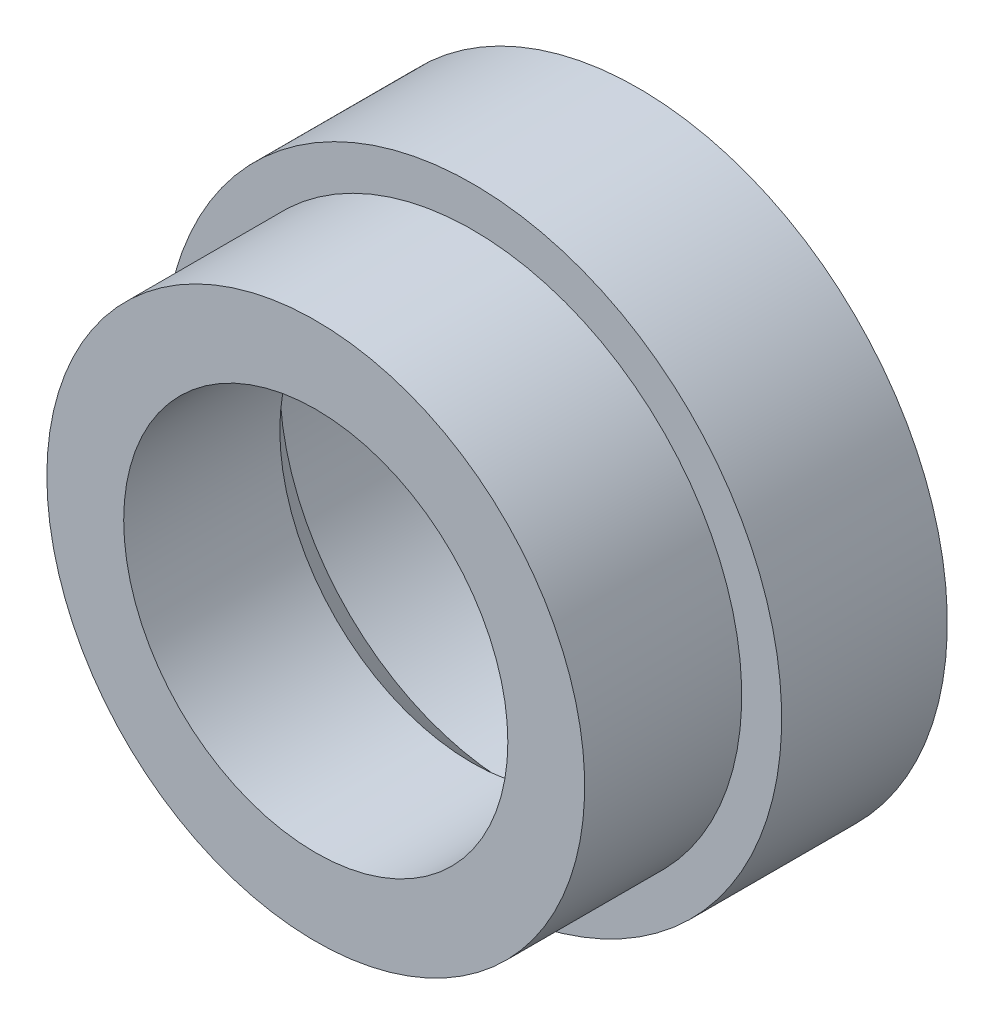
ISO-10303-21;
HEADER;
FILE_DESCRIPTION(('STEP AP214'),'2;1');
FILE_NAME('part.step','',(''),(''),'','','');
FILE_SCHEMA(('AUTOMOTIVE_DESIGN { 1 0 10303 214 1 1 1 1 }'));
ENDSEC;
DATA;
#1=APPLICATION_CONTEXT('core data for automotive mechanical design processes');
#2=APPLICATION_PROTOCOL_DEFINITION('international standard','automotive_design',2000,#1);
#3=PRODUCT_CONTEXT('',#1,'mechanical');
#4=PRODUCT('Part','Part','',(#3));
#5=PRODUCT_RELATED_PRODUCT_CATEGORY('part','',(#4));
#6=PRODUCT_DEFINITION_FORMATION('','',#4);
#7=PRODUCT_DEFINITION_CONTEXT('part definition',#1,'design');
#8=PRODUCT_DEFINITION('design','',#6,#7);
#9=PRODUCT_DEFINITION_SHAPE('','',#8);
#10=(LENGTH_UNIT() NAMED_UNIT(*) SI_UNIT(.MILLI.,.METRE.));
#11=(NAMED_UNIT(*) PLANE_ANGLE_UNIT() SI_UNIT($,.RADIAN.));
#12=(NAMED_UNIT(*) SI_UNIT($,.STERADIAN.) SOLID_ANGLE_UNIT());
#13=UNCERTAINTY_MEASURE_WITH_UNIT(LENGTH_MEASURE(1.E-05),#10,'distance_accuracy_value','');
#14=(GEOMETRIC_REPRESENTATION_CONTEXT(3) GLOBAL_UNCERTAINTY_ASSIGNED_CONTEXT((#13)) GLOBAL_UNIT_ASSIGNED_CONTEXT((#10,
#11,#12)) REPRESENTATION_CONTEXT('',''));
#15=CARTESIAN_POINT('',(0.,0.,0.));
#16=DIRECTION('',(0.,0.,1.));
#17=DIRECTION('',(1.,0.,0.));
#18=AXIS2_PLACEMENT_3D('',#15,#16,#17);
#19=CARTESIAN_POINT('',(0.,0.,0.));
#20=DIRECTION('',(0.,0.,-1.));
#21=DIRECTION('',(-1.,0.,0.));
#22=AXIS2_PLACEMENT_3D('',#19,#20,#21);
#23=CYLINDRICAL_SURFACE('',#22,20.1);
#24=CARTESIAN_POINT('',(0.,0.,10.78));
#25=DIRECTION('',(0.,0.,-1.));
#26=DIRECTION('',(-1.,0.,0.));
#27=AXIS2_PLACEMENT_3D('',#24,#25,#26);
#28=CIRCLE('',#27,20.1);
#29=CARTESIAN_POINT('',(-20.1,0.,10.78));
#30=VERTEX_POINT('',#29);
#31=EDGE_CURVE('E8',#30,#30,#28,.T.);
#32=ORIENTED_EDGE('',*,*,#31,.T.);
#33=EDGE_LOOP('',(#32));
#34=FACE_BOUND('',#33,.T.);
#35=CARTESIAN_POINT('',(0.,0.,0.));
#36=DIRECTION('',(0.,0.,-1.));
#37=DIRECTION('',(-1.,0.,0.));
#38=AXIS2_PLACEMENT_3D('',#35,#36,#37);
#39=CIRCLE('',#38,20.1);
#40=CARTESIAN_POINT('',(-20.1,0.,0.));
#41=VERTEX_POINT('',#40);
#42=EDGE_CURVE('E40',#41,#41,#39,.T.);
#43=ORIENTED_EDGE('',*,*,#42,.F.);
#44=EDGE_LOOP('',(#43));
#45=FACE_BOUND('',#44,.T.);
#46=ADVANCED_FACE('F12',(#34,#45),#23,.T.);
#47=CARTESIAN_POINT('',(0.,17.5,10.78));
#48=DIRECTION('',(0.,0.,1.));
#49=DIRECTION('',(1.,0.,0.));
#50=AXIS2_PLACEMENT_3D('',#47,#48,#49);
#51=PLANE('',#50);
#52=CARTESIAN_POINT('',(0.,0.,10.78));
#53=DIRECTION('',(0.,0.,-1.));
#54=DIRECTION('',(-1.,0.,0.));
#55=AXIS2_PLACEMENT_3D('',#52,#53,#54);
#56=CIRCLE('',#55,17.5);
#57=CARTESIAN_POINT('',(-17.5,0.,10.78));
#58=VERTEX_POINT('',#57);
#59=EDGE_CURVE('E18',#58,#58,#56,.T.);
#60=ORIENTED_EDGE('',*,*,#59,.T.);
#61=EDGE_LOOP('',(#60));
#62=FACE_BOUND('',#61,.T.);
#63=ORIENTED_EDGE('',*,*,#31,.F.);
#64=EDGE_LOOP('',(#63));
#65=FACE_BOUND('',#64,.T.);
#66=ADVANCED_FACE('F48',(#62,#65),#51,.T.);
#67=CARTESIAN_POINT('',(0.,0.,0.));
#68=DIRECTION('',(0.,0.,-1.));
#69=DIRECTION('',(-1.,0.,0.));
#70=AXIS2_PLACEMENT_3D('',#67,#68,#69);
#71=CYLINDRICAL_SURFACE('',#70,17.5);
#72=CARTESIAN_POINT('',(0.,0.,21.));
#73=DIRECTION('',(0.,0.,-1.));
#74=DIRECTION('',(-1.,0.,0.));
#75=AXIS2_PLACEMENT_3D('',#72,#73,#74);
#76=CIRCLE('',#75,17.5);
#77=CARTESIAN_POINT('',(-17.5,0.,21.));
#78=VERTEX_POINT('',#77);
#79=EDGE_CURVE('E22',#78,#78,#76,.T.);
#80=ORIENTED_EDGE('',*,*,#79,.T.);
#81=EDGE_LOOP('',(#80));
#82=FACE_BOUND('',#81,.T.);
#83=ORIENTED_EDGE('',*,*,#59,.F.);
#84=EDGE_LOOP('',(#83));
#85=FACE_BOUND('',#84,.T.);
#86=ADVANCED_FACE('F53',(#82,#85),#71,.T.);
#87=CARTESIAN_POINT('',(0.,12.5,21.));
#88=DIRECTION('',(0.,0.,1.));
#89=DIRECTION('',(1.,0.,0.));
#90=AXIS2_PLACEMENT_3D('',#87,#88,#89);
#91=PLANE('',#90);
#92=CARTESIAN_POINT('',(0.,0.,21.));
#93=DIRECTION('',(0.,0.,-1.));
#94=DIRECTION('',(-1.,0.,0.));
#95=AXIS2_PLACEMENT_3D('',#92,#93,#94);
#96=CIRCLE('',#95,12.5);
#97=CARTESIAN_POINT('',(-12.5,0.,21.));
#98=VERTEX_POINT('',#97);
#99=EDGE_CURVE('E26',#98,#98,#96,.T.);
#100=ORIENTED_EDGE('',*,*,#99,.T.);
#101=EDGE_LOOP('',(#100));
#102=FACE_BOUND('',#101,.T.);
#103=ORIENTED_EDGE('',*,*,#79,.F.);
#104=EDGE_LOOP('',(#103));
#105=FACE_BOUND('',#104,.T.);
#106=ADVANCED_FACE('F57',(#102,#105),#91,.T.);
#107=CARTESIAN_POINT('',(0.,0.,0.));
#108=DIRECTION('',(0.,0.,-1.));
#109=DIRECTION('',(-1.,0.,0.));
#110=AXIS2_PLACEMENT_3D('',#107,#108,#109);
#111=CYLINDRICAL_SURFACE('',#110,12.5);
#112=CARTESIAN_POINT('',(0.,0.,10.84));
#113=DIRECTION('',(0.,0.,-1.));
#114=DIRECTION('',(-1.,0.,0.));
#115=AXIS2_PLACEMENT_3D('',#112,#113,#114);
#116=CIRCLE('',#115,12.5);
#117=CARTESIAN_POINT('',(-12.5,0.,10.84));
#118=VERTEX_POINT('',#117);
#119=EDGE_CURVE('E31',#118,#118,#116,.T.);
#120=ORIENTED_EDGE('',*,*,#119,.T.);
#121=EDGE_LOOP('',(#120));
#122=FACE_BOUND('',#121,.T.);
#123=ORIENTED_EDGE('',*,*,#99,.F.);
#124=EDGE_LOOP('',(#123));
#125=FACE_BOUND('',#124,.T.);
#126=ADVANCED_FACE('F64',(#122,#125),#111,.F.);
#127=CARTESIAN_POINT('',(0.,0.,10.84));
#128=DIRECTION('',(0.,0.,-1.));
#129=DIRECTION('',(-1.,0.,0.));
#130=AXIS2_PLACEMENT_3D('',#127,#128,#129);
#131=CONICAL_SURFACE('',#130,12.5,0.785398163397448);
#132=CARTESIAN_POINT('',(0.,0.,8.14));
#133=DIRECTION('',(0.,0.,-1.));
#134=DIRECTION('',(-1.,0.,0.));
#135=AXIS2_PLACEMENT_3D('',#132,#133,#134);
#136=CIRCLE('',#135,15.2);
#137=CARTESIAN_POINT('',(-15.2,0.,8.14));
#138=VERTEX_POINT('',#137);
#139=EDGE_CURVE('E34',#138,#138,#136,.T.);
#140=ORIENTED_EDGE('',*,*,#139,.T.);
#141=EDGE_LOOP('',(#140));
#142=FACE_BOUND('',#141,.T.);
#143=ORIENTED_EDGE('',*,*,#119,.F.);
#144=EDGE_LOOP('',(#143));
#145=FACE_BOUND('',#144,.T.);
#146=ADVANCED_FACE('F68',(#142,#145),#131,.F.);
#147=CARTESIAN_POINT('',(0.,0.,0.));
#148=DIRECTION('',(0.,0.,-1.));
#149=DIRECTION('',(-1.,0.,0.));
#150=AXIS2_PLACEMENT_3D('',#147,#148,#149);
#151=CYLINDRICAL_SURFACE('',#150,15.2);
#152=CARTESIAN_POINT('',(0.,0.,0.));
#153=DIRECTION('',(0.,0.,-1.));
#154=DIRECTION('',(-1.,0.,0.));
#155=AXIS2_PLACEMENT_3D('',#152,#153,#154);
#156=CIRCLE('',#155,15.2);
#157=CARTESIAN_POINT('',(-15.2,0.,0.));
#158=VERTEX_POINT('',#157);
#159=EDGE_CURVE('E37',#158,#158,#156,.T.);
#160=ORIENTED_EDGE('',*,*,#159,.T.);
#161=EDGE_LOOP('',(#160));
#162=FACE_BOUND('',#161,.T.);
#163=ORIENTED_EDGE('',*,*,#139,.F.);
#164=EDGE_LOOP('',(#163));
#165=FACE_BOUND('',#164,.T.);
#166=ADVANCED_FACE('F72',(#162,#165),#151,.F.);
#167=CARTESIAN_POINT('',(0.,15.2,0.));
#168=DIRECTION('',(0.,0.,-1.));
#169=DIRECTION('',(-1.,0.,0.));
#170=AXIS2_PLACEMENT_3D('',#167,#168,#169);
#171=PLANE('',#170);
#172=ORIENTED_EDGE('',*,*,#42,.T.);
#173=EDGE_LOOP('',(#172));
#174=FACE_BOUND('',#173,.T.);
#175=ORIENTED_EDGE('',*,*,#159,.F.);
#176=EDGE_LOOP('',(#175));
#177=FACE_BOUND('',#176,.T.);
#178=ADVANCED_FACE('F44',(#174,#177),#171,.T.);
#179=CLOSED_SHELL('',(#46,#66,#86,#106,#126,#146,#166,#178));
#180=MANIFOLD_SOLID_BREP('B1',#179);
#181=ADVANCED_BREP_SHAPE_REPRESENTATION('',(#18,#180),#14);
#182=SHAPE_DEFINITION_REPRESENTATION(#9,#181);
ENDSEC;
END-ISO-10303-21;
